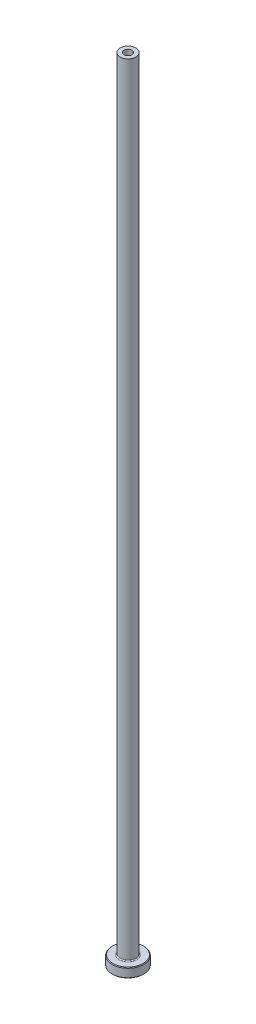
from build123d import *

# Parameters (mm, degrees)
FILLET1_R     = 0.3
CHAMFER1_SIZE = 0.2
CHAMFER3_SIZE = 0.5


with BuildPart() as part:
    # Sketch1 → Revolve1 (revolve)
    with BuildSketch(Plane.XY, mode=Mode.PRIVATE) as revolve1_sk:
        Polygon((-1.25, 250), (-2.5, 250), (-2.5, 3), (-5, 3), (-5, 0), (-1.5, 0), (-1.5, 203), (-1.25, 215), align=None)
    revolve(revolve1_sk.sketch.rotate(Axis((0, 92.187680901, 0), (0, -1, 0)), 270), axis=Axis((0, 92.187680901, 0), (0, -1, 0)))

    # Fillet1
    fillet1_edges = [part.edges().sort_by_distance(p)[0] for p in [
        (0, 3, -2.5),
    ]]
    fillet(fillet1_edges, radius=FILLET1_R)

    # Chamfer1
    chamfer1_edges = [part.edges().sort_by_distance(p)[0] for p in [
        (0, 0, -5),
        (0, 3, -5),
    ]]
    chamfer(chamfer1_edges, length=CHAMFER1_SIZE)

    # Chamfer3
    chamfer3_edges = [part.edges().sort_by_distance(p)[0] for p in [
        (0, 0, -1.5),
    ]]
    chamfer(chamfer3_edges, length=CHAMFER3_SIZE)


solid = part.part
